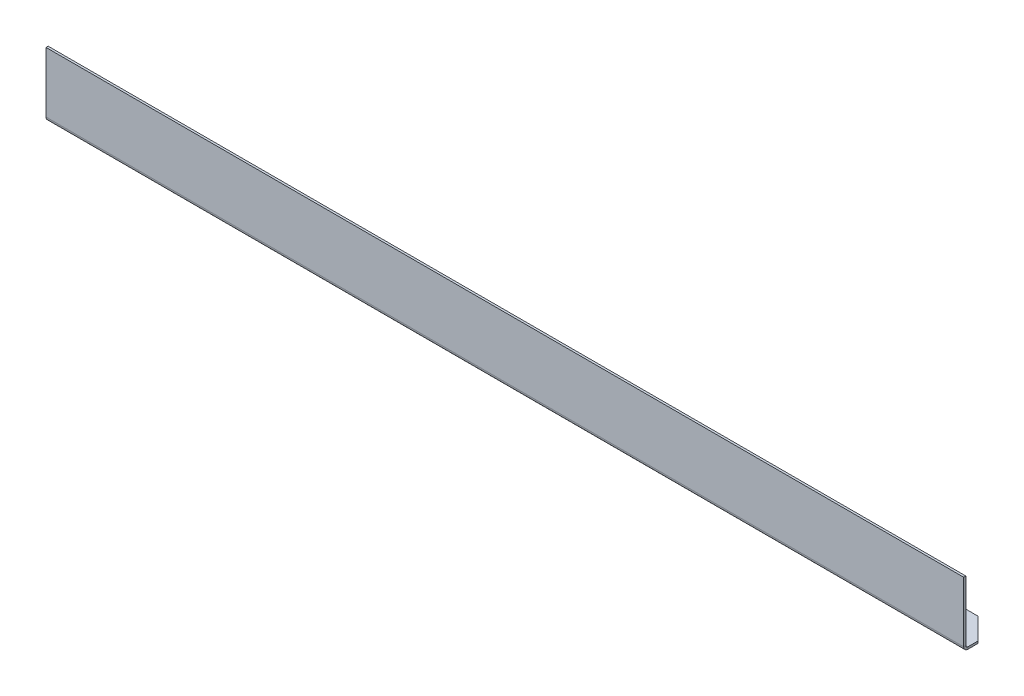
ISO-10303-21;
HEADER;
FILE_DESCRIPTION(('STEP AP214'),'2;1');
FILE_NAME('part.step','',(''),(''),'','','');
FILE_SCHEMA(('AUTOMOTIVE_DESIGN { 1 0 10303 214 1 1 1 1 }'));
ENDSEC;
DATA;
#1=APPLICATION_CONTEXT('core data for automotive mechanical design processes');
#2=APPLICATION_PROTOCOL_DEFINITION('international standard','automotive_design',2000,#1);
#3=PRODUCT_CONTEXT('',#1,'mechanical');
#4=PRODUCT('Part','Part','',(#3));
#5=PRODUCT_RELATED_PRODUCT_CATEGORY('part','',(#4));
#6=PRODUCT_DEFINITION_FORMATION('','',#4);
#7=PRODUCT_DEFINITION_CONTEXT('part definition',#1,'design');
#8=PRODUCT_DEFINITION('design','',#6,#7);
#9=PRODUCT_DEFINITION_SHAPE('','',#8);
#10=(LENGTH_UNIT() NAMED_UNIT(*) SI_UNIT(.MILLI.,.METRE.));
#11=(NAMED_UNIT(*) PLANE_ANGLE_UNIT() SI_UNIT($,.RADIAN.));
#12=(NAMED_UNIT(*) SI_UNIT($,.STERADIAN.) SOLID_ANGLE_UNIT());
#13=UNCERTAINTY_MEASURE_WITH_UNIT(LENGTH_MEASURE(1.E-05),#10,'distance_accuracy_value','');
#14=(GEOMETRIC_REPRESENTATION_CONTEXT(3) GLOBAL_UNCERTAINTY_ASSIGNED_CONTEXT((#13)) GLOBAL_UNIT_ASSIGNED_CONTEXT((#10,
#11,#12)) REPRESENTATION_CONTEXT('',''));
#15=CARTESIAN_POINT('',(0.,0.,0.));
#16=DIRECTION('',(0.,0.,1.));
#17=DIRECTION('',(1.,0.,0.));
#18=AXIS2_PLACEMENT_3D('',#15,#16,#17);
#19=CARTESIAN_POINT('',(640.,3.,-9.43689570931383E-13));
#20=DIRECTION('',(1.,0.,0.));
#21=DIRECTION('',(0.,0.,-1.));
#22=AXIS2_PLACEMENT_3D('',#19,#20,#21);
#23=PLANE('',#22);
#24=DIRECTION('',(0.,0.,-1.));
#25=VECTOR('',#24,1.);
#26=CARTESIAN_POINT('',(640.,3.,-9.43689570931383E-13));
#27=LINE('',#26,#25);
#28=CARTESIAN_POINT('',(640.,3.,-9.43689570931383E-13));
#29=VERTEX_POINT('',#28);
#30=CARTESIAN_POINT('',(640.,3.,-1.50000000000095));
#31=VERTEX_POINT('',#30);
#32=EDGE_CURVE('E230',#29,#31,#27,.T.);
#33=ORIENTED_EDGE('',*,*,#32,.F.);
#34=CARTESIAN_POINT('',(640.,3.,-3.00000000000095));
#35=DIRECTION('',(-1.,0.,0.));
#36=DIRECTION('',(0.,0.,1.));
#37=AXIS2_PLACEMENT_3D('',#34,#35,#36);
#38=CIRCLE('',#37,3.);
#39=CARTESIAN_POINT('',(640.000000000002,0.,-3.00000000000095));
#40=VERTEX_POINT('',#39);
#41=EDGE_CURVE('E201',#29,#40,#38,.F.);
#42=ORIENTED_EDGE('',*,*,#41,.T.);
#43=DIRECTION('',(0.,-1.,0.));
#44=VECTOR('',#43,1.);
#45=CARTESIAN_POINT('',(640.000000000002,1.49999999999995,-3.00000000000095));
#46=LINE('',#45,#44);
#47=CARTESIAN_POINT('',(640.000000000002,1.49999999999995,-3.00000000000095));
#48=VERTEX_POINT('',#47);
#49=EDGE_CURVE('E135',#48,#40,#46,.T.);
#50=ORIENTED_EDGE('',*,*,#49,.F.);
#51=CARTESIAN_POINT('',(640.,3.,-3.00000000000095));
#52=DIRECTION('',(1.,0.,0.));
#53=DIRECTION('',(0.,0.,-1.));
#54=AXIS2_PLACEMENT_3D('',#51,#52,#53);
#55=CIRCLE('',#54,1.5);
#56=EDGE_CURVE('E148',#31,#48,#55,.T.);
#57=ORIENTED_EDGE('',*,*,#56,.F.);
#58=EDGE_LOOP('',(#33,#42,#50,#57));
#59=FACE_BOUND('',#58,.T.);
#60=ADVANCED_FACE('F44',(#59),#23,.T.);
#61=CARTESIAN_POINT('',(640.000000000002,1.49999999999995,-3.00000000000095));
#62=DIRECTION('',(1.,0.,0.));
#63=DIRECTION('',(0.,0.,-1.));
#64=AXIS2_PLACEMENT_3D('',#61,#62,#63);
#65=PLANE('',#64);
#66=DIRECTION('',(0.,-1.,0.));
#67=VECTOR('',#66,1.);
#68=CARTESIAN_POINT('',(640.,45.,-9.43689570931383E-13));
#69=LINE('',#68,#67);
#70=CARTESIAN_POINT('',(640.,45.,-9.43689570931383E-13));
#71=VERTEX_POINT('',#70);
#72=EDGE_CURVE('E197',#71,#29,#69,.T.);
#73=ORIENTED_EDGE('',*,*,#72,.T.);
#74=ORIENTED_EDGE('',*,*,#32,.T.);
#75=DIRECTION('',(0.,-1.,0.));
#76=VECTOR('',#75,1.);
#77=CARTESIAN_POINT('',(640.,45.,-1.50000000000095));
#78=LINE('',#77,#76);
#79=CARTESIAN_POINT('',(640.,45.,-1.50000000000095));
#80=VERTEX_POINT('',#79);
#81=EDGE_CURVE('E189',#80,#31,#78,.T.);
#82=ORIENTED_EDGE('',*,*,#81,.F.);
#83=DIRECTION('',(0.,0.,-1.));
#84=VECTOR('',#83,1.);
#85=CARTESIAN_POINT('',(640.,45.,-9.43689570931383E-13));
#86=LINE('',#85,#84);
#87=EDGE_CURVE('E193',#71,#80,#86,.T.);
#88=ORIENTED_EDGE('',*,*,#87,.F.);
#89=EDGE_LOOP('',(#73,#74,#82,#88));
#90=FACE_BOUND('',#89,.T.);
#91=ADVANCED_FACE('F329',(#90),#65,.T.);
#92=CARTESIAN_POINT('',(0.,0.,-3.));
#93=DIRECTION('',(-1.,0.,0.));
#94=DIRECTION('',(0.,0.,1.));
#95=AXIS2_PLACEMENT_3D('',#92,#93,#94);
#96=PLANE('',#95);
#97=DIRECTION('',(0.,1.,0.));
#98=VECTOR('',#97,1.);
#99=CARTESIAN_POINT('',(0.,0.,-3.));
#100=LINE('',#99,#98);
#101=CARTESIAN_POINT('',(0.,0.,-3.));
#102=VERTEX_POINT('',#101);
#103=CARTESIAN_POINT('',(0.,1.49999999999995,-3.));
#104=VERTEX_POINT('',#103);
#105=EDGE_CURVE('E121',#102,#104,#100,.T.);
#106=ORIENTED_EDGE('',*,*,#105,.F.);
#107=CARTESIAN_POINT('',(0.,3.,-3.));
#108=DIRECTION('',(-1.,0.,0.));
#109=DIRECTION('',(0.,0.,1.));
#110=AXIS2_PLACEMENT_3D('',#107,#108,#109);
#111=CIRCLE('',#110,3.);
#112=CARTESIAN_POINT('',(0.,3.,0.));
#113=VERTEX_POINT('',#112);
#114=EDGE_CURVE('E178',#113,#102,#111,.F.);
#115=ORIENTED_EDGE('',*,*,#114,.F.);
#116=DIRECTION('',(0.,0.,1.));
#117=VECTOR('',#116,1.);
#118=CARTESIAN_POINT('',(0.,3.,-1.5));
#119=LINE('',#118,#117);
#120=CARTESIAN_POINT('',(0.,3.,-1.5));
#121=VERTEX_POINT('',#120);
#122=EDGE_CURVE('E136',#121,#113,#119,.T.);
#123=ORIENTED_EDGE('',*,*,#122,.F.);
#124=CARTESIAN_POINT('',(0.,3.,-3.));
#125=DIRECTION('',(1.,0.,0.));
#126=DIRECTION('',(0.,0.,-1.));
#127=AXIS2_PLACEMENT_3D('',#124,#125,#126);
#128=CIRCLE('',#127,1.5);
#129=EDGE_CURVE('E145',#121,#104,#128,.T.);
#130=ORIENTED_EDGE('',*,*,#129,.T.);
#131=EDGE_LOOP('',(#106,#115,#123,#130));
#132=FACE_BOUND('',#131,.T.);
#133=ADVANCED_FACE('F159',(#132),#96,.T.);
#134=CARTESIAN_POINT('',(0.,3.,-1.5));
#135=DIRECTION('',(-1.,0.,0.));
#136=DIRECTION('',(0.,0.,1.));
#137=AXIS2_PLACEMENT_3D('',#134,#135,#136);
#138=PLANE('',#137);
#139=DIRECTION('',(0.,0.,-1.));
#140=VECTOR('',#139,1.);
#141=CARTESIAN_POINT('',(0.,1.49999999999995,0.));
#142=LINE('',#141,#140);
#143=CARTESIAN_POINT('',(0.,1.49999999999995,-9.9999999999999));
#144=VERTEX_POINT('',#143);
#145=EDGE_CURVE('E126',#104,#144,#142,.T.);
#146=ORIENTED_EDGE('',*,*,#145,.T.);
#147=DIRECTION('',(0.,-1.,0.));
#148=VECTOR('',#147,1.);
#149=CARTESIAN_POINT('',(0.,3.,-10.));
#150=LINE('',#149,#148);
#151=CARTESIAN_POINT('',(0.,0.,-10.));
#152=VERTEX_POINT('',#151);
#153=EDGE_CURVE('E233',#144,#152,#150,.T.);
#154=ORIENTED_EDGE('',*,*,#153,.T.);
#155=DIRECTION('',(0.,0.,-1.));
#156=VECTOR('',#155,1.);
#157=CARTESIAN_POINT('',(0.,0.,0.));
#158=LINE('',#157,#156);
#159=EDGE_CURVE('E129',#102,#152,#158,.T.);
#160=ORIENTED_EDGE('',*,*,#159,.F.);
#161=ORIENTED_EDGE('',*,*,#105,.T.);
#162=EDGE_LOOP('',(#146,#154,#160,#161));
#163=FACE_BOUND('',#162,.T.);
#164=ADVANCED_FACE('F123',(#163),#138,.T.);
#165=CARTESIAN_POINT('',(640.000000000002,0.,-9.43689570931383E-13));
#166=DIRECTION('',(0.,1.,0.));
#167=DIRECTION('',(0.,0.,1.));
#168=AXIS2_PLACEMENT_3D('',#165,#166,#167);
#169=PLANE('',#168);
#170=CARTESIAN_POINT('',(587.5,-1.88737914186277E-12,-15.));
#171=DIRECTION('',(0.,1.,0.));
#172=DIRECTION('',(0.,0.,1.));
#173=AXIS2_PLACEMENT_3D('',#170,#171,#172);
#174=CIRCLE('',#173,3.39999999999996);
#175=CARTESIAN_POINT('',(587.5,-1.88737914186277E-12,-11.6000000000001));
#176=VERTEX_POINT('',#175);
#177=EDGE_CURVE('E260',#176,#176,#174,.T.);
#178=ORIENTED_EDGE('',*,*,#177,.T.);
#179=EDGE_LOOP('',(#178));
#180=FACE_BOUND('',#179,.T.);
#181=CARTESIAN_POINT('',(477.5,-1.88737914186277E-12,-15.));
#182=DIRECTION('',(0.,1.,0.));
#183=DIRECTION('',(0.,0.,1.));
#184=AXIS2_PLACEMENT_3D('',#181,#182,#183);
#185=CIRCLE('',#184,3.40000000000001);
#186=CARTESIAN_POINT('',(477.5,-1.88737914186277E-12,-11.6));
#187=VERTEX_POINT('',#186);
#188=EDGE_CURVE('E257',#187,#187,#185,.T.);
#189=ORIENTED_EDGE('',*,*,#188,.T.);
#190=EDGE_LOOP('',(#189));
#191=FACE_BOUND('',#190,.T.);
#192=CARTESIAN_POINT('',(147.5,0.,-15.));
#193=DIRECTION('',(0.,1.,0.));
#194=DIRECTION('',(0.,0.,1.));
#195=AXIS2_PLACEMENT_3D('',#192,#193,#194);
#196=CIRCLE('',#195,3.39999999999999);
#197=CARTESIAN_POINT('',(147.5,0.,-11.6));
#198=VERTEX_POINT('',#197);
#199=EDGE_CURVE('E256',#198,#198,#196,.T.);
#200=ORIENTED_EDGE('',*,*,#199,.T.);
#201=EDGE_LOOP('',(#200));
#202=FACE_BOUND('',#201,.T.);
#203=CARTESIAN_POINT('',(37.5000000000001,0.,-15.0000000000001));
#204=DIRECTION('',(0.,1.,0.));
#205=DIRECTION('',(0.,0.,1.));
#206=AXIS2_PLACEMENT_3D('',#203,#204,#205);
#207=CIRCLE('',#206,3.4);
#208=CARTESIAN_POINT('',(37.5000000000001,0.,-11.6000000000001));
#209=VERTEX_POINT('',#208);
#210=EDGE_CURVE('E285',#209,#209,#207,.T.);
#211=ORIENTED_EDGE('',*,*,#210,.T.);
#212=EDGE_LOOP('',(#211));
#213=FACE_BOUND('',#212,.T.);
#214=CARTESIAN_POINT('',(367.5,0.,-15.0000000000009));
#215=DIRECTION('',(0.,1.,0.));
#216=DIRECTION('',(0.,0.,1.));
#217=AXIS2_PLACEMENT_3D('',#214,#215,#216);
#218=CIRCLE('',#217,3.40000000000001);
#219=CARTESIAN_POINT('',(367.5,0.,-11.6000000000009));
#220=VERTEX_POINT('',#219);
#221=EDGE_CURVE('E265',#220,#220,#218,.T.);
#222=ORIENTED_EDGE('',*,*,#221,.T.);
#223=EDGE_LOOP('',(#222));
#224=FACE_BOUND('',#223,.T.);
#225=CARTESIAN_POINT('',(257.5,0.,-15.));
#226=DIRECTION('',(0.,1.,0.));
#227=DIRECTION('',(0.,0.,1.));
#228=AXIS2_PLACEMENT_3D('',#225,#226,#227);
#229=CIRCLE('',#228,3.40000000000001);
#230=CARTESIAN_POINT('',(257.5,0.,-11.6));
#231=VERTEX_POINT('',#230);
#232=EDGE_CURVE('E273',#231,#231,#229,.T.);
#233=ORIENTED_EDGE('',*,*,#232,.T.);
#234=EDGE_LOOP('',(#233));
#235=FACE_BOUND('',#234,.T.);
#236=DIRECTION('',(-1.,0.,0.));
#237=VECTOR('',#236,1.);
#238=CARTESIAN_POINT('',(640.000000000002,0.,-25.0000000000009));
#239=LINE('',#238,#237);
#240=CARTESIAN_POINT('',(625.000000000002,-1.88737914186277E-12,-25.0000000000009));
#241=VERTEX_POINT('',#240);
#242=CARTESIAN_POINT('',(15.,0.,-25.));
#243=VERTEX_POINT('',#242);
#244=EDGE_CURVE('E223',#241,#243,#239,.T.);
#245=ORIENTED_EDGE('',*,*,#244,.F.);
#246=DIRECTION('',(-0.707106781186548,0.,-0.707106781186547));
#247=VECTOR('',#246,1.);
#248=CARTESIAN_POINT('',(625.000000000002,-1.88737914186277E-12,-25.0000000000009));
#249=LINE('',#248,#247);
#250=CARTESIAN_POINT('',(640.,0.,-10.0000000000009));
#251=VERTEX_POINT('',#250);
#252=EDGE_CURVE('E66',#241,#251,#249,.F.);
#253=ORIENTED_EDGE('',*,*,#252,.T.);
#254=DIRECTION('',(0.,0.,-1.));
#255=VECTOR('',#254,1.);
#256=CARTESIAN_POINT('',(640.000000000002,0.,-9.43689570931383E-13));
#257=LINE('',#256,#255);
#258=EDGE_CURVE('E181',#40,#251,#257,.T.);
#259=ORIENTED_EDGE('',*,*,#258,.F.);
#260=DIRECTION('',(-1.,0.,0.));
#261=VECTOR('',#260,1.);
#262=CARTESIAN_POINT('',(640.000000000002,0.,-3.00000000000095));
#263=LINE('',#262,#261);
#264=EDGE_CURVE('E205',#40,#102,#263,.T.);
#265=ORIENTED_EDGE('',*,*,#264,.T.);
#266=ORIENTED_EDGE('',*,*,#159,.T.);
#267=DIRECTION('',(-0.707106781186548,0.,0.707106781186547));
#268=VECTOR('',#267,1.);
#269=CARTESIAN_POINT('',(0.,0.,-10.));
#270=LINE('',#269,#268);
#271=EDGE_CURVE('E236',#152,#243,#270,.F.);
#272=ORIENTED_EDGE('',*,*,#271,.T.);
#273=EDGE_LOOP('',(#245,#253,#259,#265,#266,#272));
#274=FACE_BOUND('',#273,.T.);
#275=ADVANCED_FACE('F346',(#180,#191,#202,#213,#224,#235,#274),#169,.F.);
#276=CARTESIAN_POINT('',(640.000000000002,1.49999999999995,-25.0000000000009));
#277=DIRECTION('',(0.,0.,-1.));
#278=DIRECTION('',(-1.,0.,0.));
#279=AXIS2_PLACEMENT_3D('',#276,#277,#278);
#280=PLANE('',#279);
#281=DIRECTION('',(-1.,0.,0.));
#282=VECTOR('',#281,1.);
#283=CARTESIAN_POINT('',(640.000000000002,1.49999999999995,-25.0000000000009));
#284=LINE('',#283,#282);
#285=CARTESIAN_POINT('',(625.000000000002,1.49999999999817,-25.0000000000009));
#286=VERTEX_POINT('',#285);
#287=CARTESIAN_POINT('',(15.0000000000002,1.49999999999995,-25.));
#288=VERTEX_POINT('',#287);
#289=EDGE_CURVE('E151',#286,#288,#284,.T.);
#290=ORIENTED_EDGE('',*,*,#289,.F.);
#291=DIRECTION('',(0.,-1.,0.));
#292=VECTOR('',#291,1.);
#293=CARTESIAN_POINT('',(625.000000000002,1.49999999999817,-25.0000000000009));
#294=LINE('',#293,#292);
#295=EDGE_CURVE('E246',#286,#241,#294,.T.);
#296=ORIENTED_EDGE('',*,*,#295,.T.);
#297=ORIENTED_EDGE('',*,*,#244,.T.);
#298=DIRECTION('',(0.,1.,0.));
#299=VECTOR('',#298,1.);
#300=CARTESIAN_POINT('',(15.,1.49999999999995,-25.));
#301=LINE('',#300,#299);
#302=EDGE_CURVE('E240',#243,#288,#301,.T.);
#303=ORIENTED_EDGE('',*,*,#302,.T.);
#304=EDGE_LOOP('',(#290,#296,#297,#303));
#305=FACE_BOUND('',#304,.T.);
#306=ADVANCED_FACE('F307',(#305),#280,.T.);
#307=CARTESIAN_POINT('',(640.000000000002,1.49999999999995,-9.43689570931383E-13));
#308=DIRECTION('',(0.,1.,0.));
#309=DIRECTION('',(0.,0.,1.));
#310=AXIS2_PLACEMENT_3D('',#307,#308,#309);
#311=PLANE('',#310);
#312=CARTESIAN_POINT('',(587.500000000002,1.49999999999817,-15.));
#313=DIRECTION('',(0.,1.,0.));
#314=DIRECTION('',(0.,0.,1.));
#315=AXIS2_PLACEMENT_3D('',#312,#313,#314);
#316=CIRCLE('',#315,3.39999999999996);
#317=CARTESIAN_POINT('',(587.500000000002,1.49999999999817,-11.6000000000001));
#318=VERTEX_POINT('',#317);
#319=EDGE_CURVE('E262',#318,#318,#316,.T.);
#320=ORIENTED_EDGE('',*,*,#319,.F.);
#321=EDGE_LOOP('',(#320));
#322=FACE_BOUND('',#321,.T.);
#323=CARTESIAN_POINT('',(477.5,1.49999999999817,-15.));
#324=DIRECTION('',(0.,1.,0.));
#325=DIRECTION('',(0.,0.,1.));
#326=AXIS2_PLACEMENT_3D('',#323,#324,#325);
#327=CIRCLE('',#326,3.40000000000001);
#328=CARTESIAN_POINT('',(477.5,1.49999999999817,-11.6));
#329=VERTEX_POINT('',#328);
#330=EDGE_CURVE('E254',#329,#329,#327,.T.);
#331=ORIENTED_EDGE('',*,*,#330,.F.);
#332=EDGE_LOOP('',(#331));
#333=FACE_BOUND('',#332,.T.);
#334=CARTESIAN_POINT('',(147.5,1.50000000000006,-15.));
#335=DIRECTION('',(0.,1.,0.));
#336=DIRECTION('',(0.,0.,1.));
#337=AXIS2_PLACEMENT_3D('',#334,#335,#336);
#338=CIRCLE('',#337,3.39999999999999);
#339=CARTESIAN_POINT('',(147.5,1.50000000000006,-11.6));
#340=VERTEX_POINT('',#339);
#341=EDGE_CURVE('E283',#340,#340,#338,.T.);
#342=ORIENTED_EDGE('',*,*,#341,.F.);
#343=EDGE_LOOP('',(#342));
#344=FACE_BOUND('',#343,.T.);
#345=CARTESIAN_POINT('',(37.5000000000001,1.49999999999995,-15.0000000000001));
#346=DIRECTION('',(0.,1.,0.));
#347=DIRECTION('',(0.,0.,1.));
#348=AXIS2_PLACEMENT_3D('',#345,#346,#347);
#349=CIRCLE('',#348,3.4);
#350=CARTESIAN_POINT('',(37.5000000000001,1.49999999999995,-11.6000000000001));
#351=VERTEX_POINT('',#350);
#352=EDGE_CURVE('E269',#351,#351,#349,.T.);
#353=ORIENTED_EDGE('',*,*,#352,.F.);
#354=EDGE_LOOP('',(#353));
#355=FACE_BOUND('',#354,.T.);
#356=CARTESIAN_POINT('',(367.5,1.50000000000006,-15.0000000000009));
#357=DIRECTION('',(0.,1.,0.));
#358=DIRECTION('',(0.,0.,1.));
#359=AXIS2_PLACEMENT_3D('',#356,#357,#358);
#360=CIRCLE('',#359,3.40000000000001);
#361=CARTESIAN_POINT('',(367.5,1.50000000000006,-11.6000000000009));
#362=VERTEX_POINT('',#361);
#363=EDGE_CURVE('E268',#362,#362,#360,.T.);
#364=ORIENTED_EDGE('',*,*,#363,.F.);
#365=EDGE_LOOP('',(#364));
#366=FACE_BOUND('',#365,.T.);
#367=CARTESIAN_POINT('',(257.5,1.50000000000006,-15.));
#368=DIRECTION('',(0.,1.,0.));
#369=DIRECTION('',(0.,0.,1.));
#370=AXIS2_PLACEMENT_3D('',#367,#368,#369);
#371=CIRCLE('',#370,3.40000000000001);
#372=CARTESIAN_POINT('',(257.5,1.50000000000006,-11.6));
#373=VERTEX_POINT('',#372);
#374=EDGE_CURVE('E271',#373,#373,#371,.T.);
#375=ORIENTED_EDGE('',*,*,#374,.F.);
#376=EDGE_LOOP('',(#375));
#377=FACE_BOUND('',#376,.T.);
#378=DIRECTION('',(0.,0.,-1.));
#379=VECTOR('',#378,1.);
#380=CARTESIAN_POINT('',(640.000000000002,1.49999999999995,-9.43689570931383E-13));
#381=LINE('',#380,#379);
#382=CARTESIAN_POINT('',(640.,1.49999999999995,-10.000000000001));
#383=VERTEX_POINT('',#382);
#384=EDGE_CURVE('E184',#48,#383,#381,.T.);
#385=ORIENTED_EDGE('',*,*,#384,.T.);
#386=DIRECTION('',(0.707106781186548,0.,0.707106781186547));
#387=VECTOR('',#386,1.);
#388=CARTESIAN_POINT('',(645.,1.49999999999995,-5.));
#389=LINE('',#388,#387);
#390=EDGE_CURVE('E11',#383,#286,#389,.F.);
#391=ORIENTED_EDGE('',*,*,#390,.T.);
#392=ORIENTED_EDGE('',*,*,#289,.T.);
#393=DIRECTION('',(0.707106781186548,0.,-0.707106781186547));
#394=VECTOR('',#393,1.);
#395=CARTESIAN_POINT('',(315.,1.49999999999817,-325.));
#396=LINE('',#395,#394);
#397=EDGE_CURVE('E156',#288,#144,#396,.F.);
#398=ORIENTED_EDGE('',*,*,#397,.T.);
#399=ORIENTED_EDGE('',*,*,#145,.F.);
#400=DIRECTION('',(-1.,0.,0.));
#401=VECTOR('',#400,1.);
#402=CARTESIAN_POINT('',(640.000000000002,1.49999999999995,-3.00000000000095));
#403=LINE('',#402,#401);
#404=EDGE_CURVE('E142',#48,#104,#403,.T.);
#405=ORIENTED_EDGE('',*,*,#404,.F.);
#406=EDGE_LOOP('',(#385,#391,#392,#398,#399,#405));
#407=FACE_BOUND('',#406,.T.);
#408=ADVANCED_FACE('F154',(#322,#333,#344,#355,#366,#377,#407),#311,.T.);
#409=CARTESIAN_POINT('',(640.,3.,-3.00000000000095));
#410=DIRECTION('',(-1.,0.,0.));
#411=DIRECTION('',(0.,0.,1.));
#412=AXIS2_PLACEMENT_3D('',#409,#410,#411);
#413=CYLINDRICAL_SURFACE('',#412,1.5);
#414=ORIENTED_EDGE('',*,*,#129,.F.);
#415=DIRECTION('',(-1.,0.,0.));
#416=VECTOR('',#415,1.);
#417=CARTESIAN_POINT('',(640.,3.,-1.50000000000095));
#418=LINE('',#417,#416);
#419=EDGE_CURVE('E152',#31,#121,#418,.T.);
#420=ORIENTED_EDGE('',*,*,#419,.F.);
#421=ORIENTED_EDGE('',*,*,#56,.T.);
#422=ORIENTED_EDGE('',*,*,#404,.T.);
#423=EDGE_LOOP('',(#414,#420,#421,#422));
#424=FACE_BOUND('',#423,.T.);
#425=ADVANCED_FACE('F143',(#424),#413,.F.);
#426=CARTESIAN_POINT('',(640.,45.,-1.50000000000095));
#427=DIRECTION('',(0.,0.,-1.));
#428=DIRECTION('',(0.,1.,0.));
#429=AXIS2_PLACEMENT_3D('',#426,#427,#428);
#430=PLANE('',#429);
#431=DIRECTION('',(0.,-1.,0.));
#432=VECTOR('',#431,1.);
#433=CARTESIAN_POINT('',(0.,45.,-1.5));
#434=LINE('',#433,#432);
#435=CARTESIAN_POINT('',(0.,45.,-1.5));
#436=VERTEX_POINT('',#435);
#437=EDGE_CURVE('E162',#436,#121,#434,.T.);
#438=ORIENTED_EDGE('',*,*,#437,.F.);
#439=DIRECTION('',(-1.,0.,0.));
#440=VECTOR('',#439,1.);
#441=CARTESIAN_POINT('',(640.,45.,-1.50000000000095));
#442=LINE('',#441,#440);
#443=EDGE_CURVE('E216',#80,#436,#442,.T.);
#444=ORIENTED_EDGE('',*,*,#443,.F.);
#445=ORIENTED_EDGE('',*,*,#81,.T.);
#446=ORIENTED_EDGE('',*,*,#419,.T.);
#447=EDGE_LOOP('',(#438,#444,#445,#446));
#448=FACE_BOUND('',#447,.T.);
#449=ADVANCED_FACE('F428',(#448),#430,.T.);
#450=CARTESIAN_POINT('',(640.,45.,-9.43689570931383E-13));
#451=DIRECTION('',(0.,1.,0.));
#452=DIRECTION('',(0.,0.,1.));
#453=AXIS2_PLACEMENT_3D('',#450,#451,#452);
#454=PLANE('',#453);
#455=DIRECTION('',(0.,0.,-1.));
#456=VECTOR('',#455,1.);
#457=CARTESIAN_POINT('',(0.,45.,0.));
#458=LINE('',#457,#456);
#459=CARTESIAN_POINT('',(0.,45.,0.));
#460=VERTEX_POINT('',#459);
#461=EDGE_CURVE('E167',#460,#436,#458,.T.);
#462=ORIENTED_EDGE('',*,*,#461,.F.);
#463=DIRECTION('',(-1.,0.,0.));
#464=VECTOR('',#463,1.);
#465=CARTESIAN_POINT('',(640.,45.,-9.43689570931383E-13));
#466=LINE('',#465,#464);
#467=EDGE_CURVE('E213',#71,#460,#466,.T.);
#468=ORIENTED_EDGE('',*,*,#467,.F.);
#469=ORIENTED_EDGE('',*,*,#87,.T.);
#470=ORIENTED_EDGE('',*,*,#443,.T.);
#471=EDGE_LOOP('',(#462,#468,#469,#470));
#472=FACE_BOUND('',#471,.T.);
#473=ADVANCED_FACE('F436',(#472),#454,.T.);
#474=CARTESIAN_POINT('',(640.,45.,-9.43689570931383E-13));
#475=DIRECTION('',(0.,0.,-1.));
#476=DIRECTION('',(0.,1.,0.));
#477=AXIS2_PLACEMENT_3D('',#474,#475,#476);
#478=PLANE('',#477);
#479=DIRECTION('',(0.,-1.,0.));
#480=VECTOR('',#479,1.);
#481=CARTESIAN_POINT('',(0.,45.,0.));
#482=LINE('',#481,#480);
#483=EDGE_CURVE('E174',#460,#113,#482,.T.);
#484=ORIENTED_EDGE('',*,*,#483,.T.);
#485=DIRECTION('',(-1.,0.,0.));
#486=VECTOR('',#485,1.);
#487=CARTESIAN_POINT('',(640.,3.,-9.43689570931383E-13));
#488=LINE('',#487,#486);
#489=EDGE_CURVE('E209',#29,#113,#488,.T.);
#490=ORIENTED_EDGE('',*,*,#489,.F.);
#491=ORIENTED_EDGE('',*,*,#72,.F.);
#492=ORIENTED_EDGE('',*,*,#467,.T.);
#493=EDGE_LOOP('',(#484,#490,#491,#492));
#494=FACE_BOUND('',#493,.T.);
#495=ADVANCED_FACE('F342',(#494),#478,.F.);
#496=CARTESIAN_POINT('',(640.,3.,-3.00000000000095));
#497=DIRECTION('',(-1.,0.,0.));
#498=DIRECTION('',(0.,0.,1.));
#499=AXIS2_PLACEMENT_3D('',#496,#497,#498);
#500=CYLINDRICAL_SURFACE('',#499,3.);
#501=ORIENTED_EDGE('',*,*,#114,.T.);
#502=ORIENTED_EDGE('',*,*,#264,.F.);
#503=ORIENTED_EDGE('',*,*,#41,.F.);
#504=ORIENTED_EDGE('',*,*,#489,.T.);
#505=EDGE_LOOP('',(#501,#502,#503,#504));
#506=FACE_BOUND('',#505,.T.);
#507=ADVANCED_FACE('F345',(#506),#500,.T.);
#508=CARTESIAN_POINT('',(640.,3.,-3.00000000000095));
#509=DIRECTION('',(1.,0.,0.));
#510=DIRECTION('',(0.,0.,-1.));
#511=AXIS2_PLACEMENT_3D('',#508,#509,#510);
#512=PLANE('',#511);
#513=ORIENTED_EDGE('',*,*,#258,.T.);
#514=DIRECTION('',(0.,1.,0.));
#515=VECTOR('',#514,1.);
#516=CARTESIAN_POINT('',(639.999999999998,3.,-10.0000000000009));
#517=LINE('',#516,#515);
#518=EDGE_CURVE('E52',#251,#383,#517,.T.);
#519=ORIENTED_EDGE('',*,*,#518,.T.);
#520=ORIENTED_EDGE('',*,*,#384,.F.);
#521=ORIENTED_EDGE('',*,*,#49,.T.);
#522=EDGE_LOOP('',(#513,#519,#520,#521));
#523=FACE_BOUND('',#522,.T.);
#524=ADVANCED_FACE('F324',(#523),#512,.T.);
#525=CARTESIAN_POINT('',(0.,3.,-3.));
#526=DIRECTION('',(1.,0.,0.));
#527=DIRECTION('',(0.,0.,-1.));
#528=AXIS2_PLACEMENT_3D('',#525,#526,#527);
#529=PLANE('',#528);
#530=ORIENTED_EDGE('',*,*,#437,.T.);
#531=ORIENTED_EDGE('',*,*,#122,.T.);
#532=ORIENTED_EDGE('',*,*,#483,.F.);
#533=ORIENTED_EDGE('',*,*,#461,.T.);
#534=EDGE_LOOP('',(#530,#531,#532,#533));
#535=FACE_BOUND('',#534,.T.);
#536=ADVANCED_FACE('F314',(#535),#529,.F.);
#537=CARTESIAN_POINT('',(257.5,1.50000000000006,-15.));
#538=DIRECTION('',(0.,1.,0.));
#539=DIRECTION('',(0.,0.,1.));
#540=AXIS2_PLACEMENT_3D('',#537,#538,#539);
#541=CYLINDRICAL_SURFACE('',#540,3.40000000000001);
#542=ORIENTED_EDGE('',*,*,#232,.F.);
#543=EDGE_LOOP('',(#542));
#544=FACE_BOUND('',#543,.T.);
#545=ORIENTED_EDGE('',*,*,#374,.T.);
#546=EDGE_LOOP('',(#545));
#547=FACE_BOUND('',#546,.T.);
#548=ADVANCED_FACE('F312',(#544,#547),#541,.F.);
#549=CARTESIAN_POINT('',(367.5,1.50000000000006,-15.0000000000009));
#550=DIRECTION('',(0.,1.,0.));
#551=DIRECTION('',(0.,0.,1.));
#552=AXIS2_PLACEMENT_3D('',#549,#550,#551);
#553=CYLINDRICAL_SURFACE('',#552,3.40000000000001);
#554=ORIENTED_EDGE('',*,*,#221,.F.);
#555=EDGE_LOOP('',(#554));
#556=FACE_BOUND('',#555,.T.);
#557=ORIENTED_EDGE('',*,*,#363,.T.);
#558=EDGE_LOOP('',(#557));
#559=FACE_BOUND('',#558,.T.);
#560=ADVANCED_FACE('F303',(#556,#559),#553,.F.);
#561=CARTESIAN_POINT('',(37.5000000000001,1.49999999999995,-15.0000000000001));
#562=DIRECTION('',(0.,1.,0.));
#563=DIRECTION('',(0.,0.,1.));
#564=AXIS2_PLACEMENT_3D('',#561,#562,#563);
#565=CYLINDRICAL_SURFACE('',#564,3.4);
#566=ORIENTED_EDGE('',*,*,#210,.F.);
#567=EDGE_LOOP('',(#566));
#568=FACE_BOUND('',#567,.T.);
#569=ORIENTED_EDGE('',*,*,#352,.T.);
#570=EDGE_LOOP('',(#569));
#571=FACE_BOUND('',#570,.T.);
#572=ADVANCED_FACE('F321',(#568,#571),#565,.F.);
#573=CARTESIAN_POINT('',(147.5,1.50000000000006,-15.));
#574=DIRECTION('',(0.,1.,0.));
#575=DIRECTION('',(0.,0.,1.));
#576=AXIS2_PLACEMENT_3D('',#573,#574,#575);
#577=CYLINDRICAL_SURFACE('',#576,3.39999999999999);
#578=ORIENTED_EDGE('',*,*,#199,.F.);
#579=EDGE_LOOP('',(#578));
#580=FACE_BOUND('',#579,.T.);
#581=ORIENTED_EDGE('',*,*,#341,.T.);
#582=EDGE_LOOP('',(#581));
#583=FACE_BOUND('',#582,.T.);
#584=ADVANCED_FACE('F370',(#580,#583),#577,.F.);
#585=CARTESIAN_POINT('',(477.5,1.49999999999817,-15.));
#586=DIRECTION('',(0.,1.,0.));
#587=DIRECTION('',(0.,0.,1.));
#588=AXIS2_PLACEMENT_3D('',#585,#586,#587);
#589=CYLINDRICAL_SURFACE('',#588,3.40000000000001);
#590=ORIENTED_EDGE('',*,*,#188,.F.);
#591=EDGE_LOOP('',(#590));
#592=FACE_BOUND('',#591,.T.);
#593=ORIENTED_EDGE('',*,*,#330,.T.);
#594=EDGE_LOOP('',(#593));
#595=FACE_BOUND('',#594,.T.);
#596=ADVANCED_FACE('F364',(#592,#595),#589,.F.);
#597=CARTESIAN_POINT('',(587.500000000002,1.49999999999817,-15.));
#598=DIRECTION('',(0.,1.,0.));
#599=DIRECTION('',(0.,0.,1.));
#600=AXIS2_PLACEMENT_3D('',#597,#598,#599);
#601=CYLINDRICAL_SURFACE('',#600,3.39999999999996);
#602=ORIENTED_EDGE('',*,*,#177,.F.);
#603=EDGE_LOOP('',(#602));
#604=FACE_BOUND('',#603,.T.);
#605=ORIENTED_EDGE('',*,*,#319,.T.);
#606=EDGE_LOOP('',(#605));
#607=FACE_BOUND('',#606,.T.);
#608=ADVANCED_FACE('F357',(#604,#607),#601,.F.);
#609=CARTESIAN_POINT('',(0.,3.,-10.));
#610=DIRECTION('',(0.707106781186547,0.,0.707106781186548));
#611=DIRECTION('',(0.707106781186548,0.,-0.707106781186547));
#612=AXIS2_PLACEMENT_3D('',#609,#610,#611);
#613=PLANE('',#612);
#614=ORIENTED_EDGE('',*,*,#397,.F.);
#615=ORIENTED_EDGE('',*,*,#302,.F.);
#616=ORIENTED_EDGE('',*,*,#271,.F.);
#617=ORIENTED_EDGE('',*,*,#153,.F.);
#618=EDGE_LOOP('',(#614,#615,#616,#617));
#619=FACE_BOUND('',#618,.T.);
#620=ADVANCED_FACE('F355',(#619),#613,.F.);
#621=CARTESIAN_POINT('',(625.000000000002,1.49999999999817,-25.0000000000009));
#622=DIRECTION('',(-0.707106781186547,0.,0.707106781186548));
#623=DIRECTION('',(0.707106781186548,0.,0.707106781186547));
#624=AXIS2_PLACEMENT_3D('',#621,#622,#623);
#625=PLANE('',#624);
#626=ORIENTED_EDGE('',*,*,#390,.F.);
#627=ORIENTED_EDGE('',*,*,#518,.F.);
#628=ORIENTED_EDGE('',*,*,#252,.F.);
#629=ORIENTED_EDGE('',*,*,#295,.F.);
#630=EDGE_LOOP('',(#626,#627,#628,#629));
#631=FACE_BOUND('',#630,.T.);
#632=ADVANCED_FACE('F349',(#631),#625,.F.);
#633=CLOSED_SHELL('',(#60,#91,#133,#164,#275,#306,#408,#425,#449,#473,#495,#507,#524,#536,#548,
#560,#572,#584,#596,#608,#620,#632));
#634=MANIFOLD_SOLID_BREP('B2',#633);
#635=ADVANCED_BREP_SHAPE_REPRESENTATION('',(#18,#634),#14);
#636=SHAPE_DEFINITION_REPRESENTATION(#9,#635);
ENDSEC;
END-ISO-10303-21;
